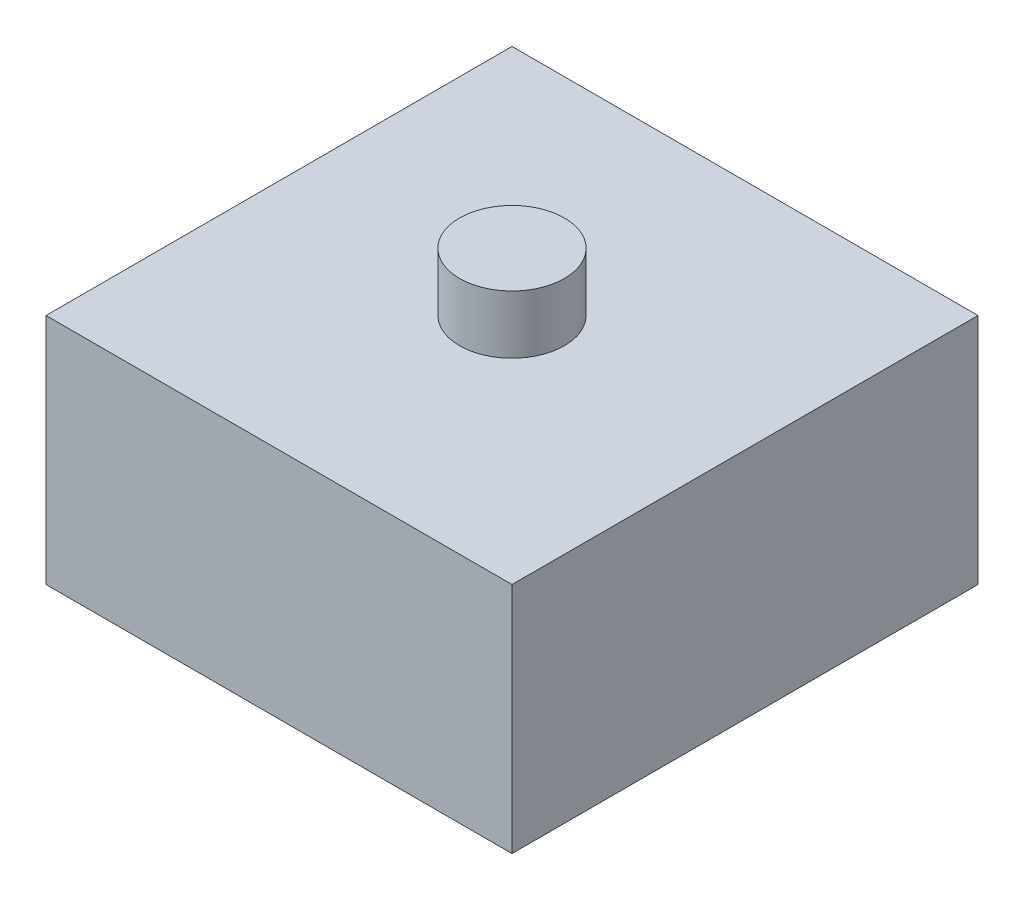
from build123d import *

# Parameters (mm, degrees)
ESQUISSE1_W        = 400
ESQUISSE1_H        = 200
BOSS_EXTRU_1_DEPTH = 400
ESQUISSE3_R        = 45
BOSS_EXTRU_2_DEPTH = 50


with BuildPart() as part:
    # Esquisse1 → Boss.-Extru.1 (new body)
    with BuildSketch(Plane.XY):
        with Locations((-103.811551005, -37.598737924)):
            Rectangle(ESQUISSE1_W, ESQUISSE1_H)
    extrude(amount=BOSS_EXTRU_1_DEPTH)

    # Esquisse3 → Boss.-Extru.2 (add)
    with BuildSketch(Plane(origin=(0, 62.401262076, 0), x_dir=(1, 0, 0), z_dir=(0, 1, 0))):
        with Locations(Location((-103.811551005, -200, 0), (0, 0, 270))):
            Circle(ESQUISSE3_R)
    extrude(amount=BOSS_EXTRU_2_DEPTH)


solid = part.part
